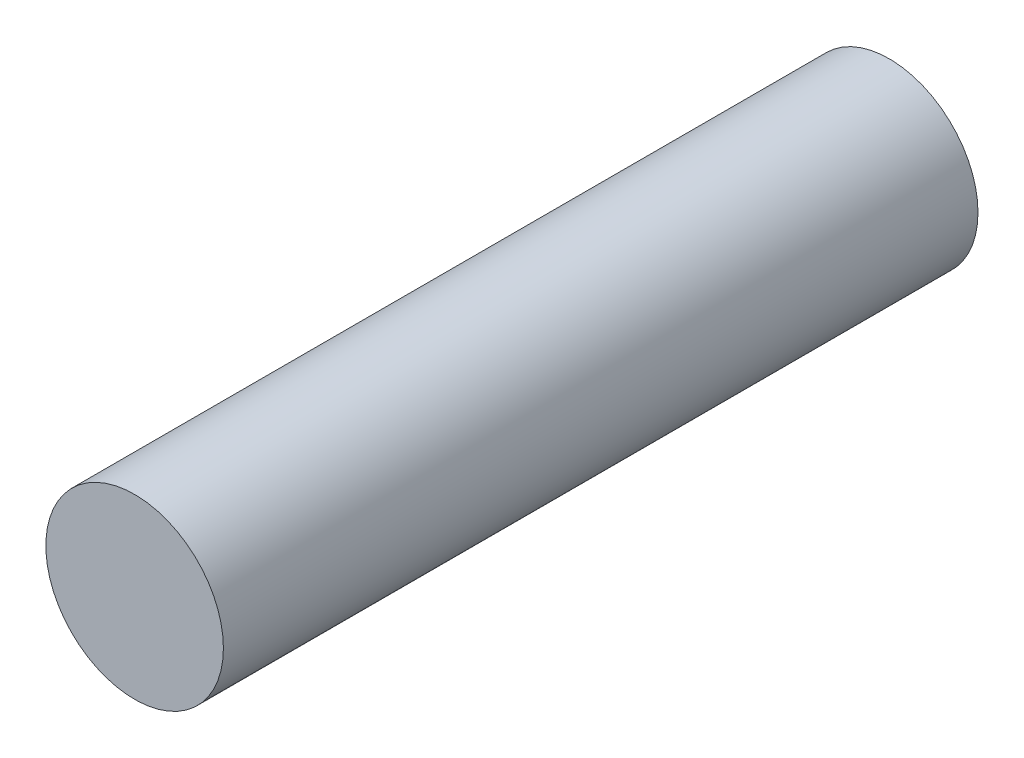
ISO-10303-21;
HEADER;
FILE_DESCRIPTION(('STEP AP214'),'2;1');
FILE_NAME('part.step','',(''),(''),'','','');
FILE_SCHEMA(('AUTOMOTIVE_DESIGN { 1 0 10303 214 1 1 1 1 }'));
ENDSEC;
DATA;
#1=APPLICATION_CONTEXT('core data for automotive mechanical design processes');
#2=APPLICATION_PROTOCOL_DEFINITION('international standard','automotive_design',2000,#1);
#3=PRODUCT_CONTEXT('',#1,'mechanical');
#4=PRODUCT('Part','Part','',(#3));
#5=PRODUCT_RELATED_PRODUCT_CATEGORY('part','',(#4));
#6=PRODUCT_DEFINITION_FORMATION('','',#4);
#7=PRODUCT_DEFINITION_CONTEXT('part definition',#1,'design');
#8=PRODUCT_DEFINITION('design','',#6,#7);
#9=PRODUCT_DEFINITION_SHAPE('','',#8);
#10=(LENGTH_UNIT() NAMED_UNIT(*) SI_UNIT(.MILLI.,.METRE.));
#11=(NAMED_UNIT(*) PLANE_ANGLE_UNIT() SI_UNIT($,.RADIAN.));
#12=(NAMED_UNIT(*) SI_UNIT($,.STERADIAN.) SOLID_ANGLE_UNIT());
#13=UNCERTAINTY_MEASURE_WITH_UNIT(LENGTH_MEASURE(1.E-05),#10,'distance_accuracy_value','');
#14=(GEOMETRIC_REPRESENTATION_CONTEXT(3) GLOBAL_UNCERTAINTY_ASSIGNED_CONTEXT((#13)) GLOBAL_UNIT_ASSIGNED_CONTEXT((#10,
#11,#12)) REPRESENTATION_CONTEXT('',''));
#15=CARTESIAN_POINT('',(0.,0.,0.));
#16=DIRECTION('',(0.,0.,1.));
#17=DIRECTION('',(1.,0.,0.));
#18=AXIS2_PLACEMENT_3D('',#15,#16,#17);
#19=CARTESIAN_POINT('',(0.,0.,86.36));
#20=DIRECTION('',(0.,0.,-1.));
#21=DIRECTION('',(-1.,0.,0.));
#22=AXIS2_PLACEMENT_3D('',#19,#20,#21);
#23=CYLINDRICAL_SURFACE('',#22,10.16);
#24=CARTESIAN_POINT('',(0.,0.,86.36));
#25=DIRECTION('',(0.,0.,1.));
#26=DIRECTION('',(1.,0.,0.));
#27=AXIS2_PLACEMENT_3D('',#24,#25,#26);
#28=CIRCLE('',#27,10.16);
#29=CARTESIAN_POINT('',(10.16,0.,86.36));
#30=VERTEX_POINT('',#29);
#31=EDGE_CURVE('E10',#30,#30,#28,.T.);
#32=ORIENTED_EDGE('',*,*,#31,.F.);
#33=EDGE_LOOP('',(#32));
#34=FACE_BOUND('',#33,.T.);
#35=CARTESIAN_POINT('',(0.,0.,0.));
#36=DIRECTION('',(0.,0.,1.));
#37=DIRECTION('',(1.,0.,0.));
#38=AXIS2_PLACEMENT_3D('',#35,#36,#37);
#39=CIRCLE('',#38,10.16);
#40=CARTESIAN_POINT('',(10.16,0.,0.));
#41=VERTEX_POINT('',#40);
#42=EDGE_CURVE('E43',#41,#41,#39,.T.);
#43=ORIENTED_EDGE('',*,*,#42,.T.);
#44=EDGE_LOOP('',(#43));
#45=FACE_BOUND('',#44,.T.);
#46=ADVANCED_FACE('F40',(#34,#45),#23,.T.);
#47=CARTESIAN_POINT('',(0.,0.,86.36));
#48=DIRECTION('',(0.,0.,1.));
#49=DIRECTION('',(1.,0.,0.));
#50=AXIS2_PLACEMENT_3D('',#47,#48,#49);
#51=PLANE('',#50);
#52=ORIENTED_EDGE('',*,*,#31,.T.);
#53=EDGE_LOOP('',(#52));
#54=FACE_BOUND('',#53,.T.);
#55=ADVANCED_FACE('F55',(#54),#51,.T.);
#56=CARTESIAN_POINT('',(0.,0.,0.));
#57=DIRECTION('',(0.,0.,1.));
#58=DIRECTION('',(1.,0.,0.));
#59=AXIS2_PLACEMENT_3D('',#56,#57,#58);
#60=PLANE('',#59);
#61=ORIENTED_EDGE('',*,*,#42,.F.);
#62=EDGE_LOOP('',(#61));
#63=FACE_BOUND('',#62,.T.);
#64=ADVANCED_FACE('F53',(#63),#60,.F.);
#65=CLOSED_SHELL('',(#46,#55,#64));
#66=MANIFOLD_SOLID_BREP('B2',#65);
#67=ADVANCED_BREP_SHAPE_REPRESENTATION('',(#18,#66),#14);
#68=SHAPE_DEFINITION_REPRESENTATION(#9,#67);
ENDSEC;
END-ISO-10303-21;
